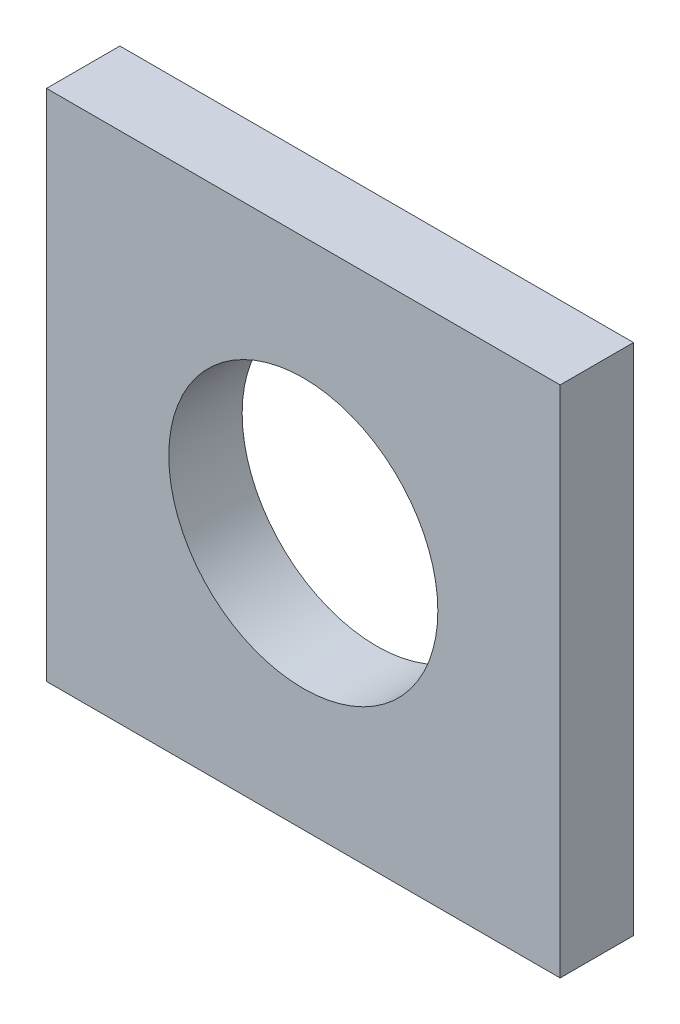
from build123d import *

# Parameters (mm, degrees)
SKETCH1_W           = 42
SKETCH1_H           = 42
SKETCH1_R           = 11
BOSS_EXTRUDE1_DEPTH = 6


with BuildPart() as part:
    # Sketch1 → Boss-Extrude1 (new body)
    with BuildSketch(Plane.XY):
        with Locations((-32.595206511, 15.231453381)):
            Rectangle(SKETCH1_W, SKETCH1_H)
        with Locations((-32.595206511, 15.231453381)):
            Circle(SKETCH1_R, mode=Mode.SUBTRACT)
    extrude(amount=BOSS_EXTRUDE1_DEPTH)


solid = part.part
